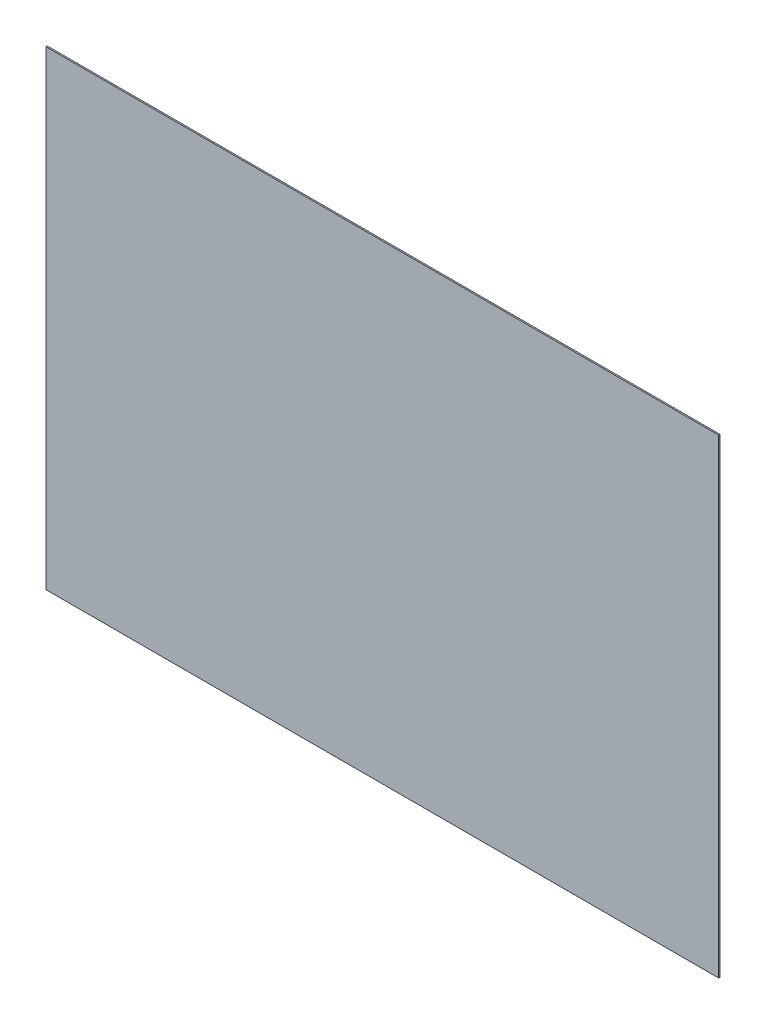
ISO-10303-21;
HEADER;
FILE_DESCRIPTION(('STEP AP214'),'2;1');
FILE_NAME('part.step','',(''),(''),'','','');
FILE_SCHEMA(('AUTOMOTIVE_DESIGN { 1 0 10303 214 1 1 1 1 }'));
ENDSEC;
DATA;
#1=APPLICATION_CONTEXT('core data for automotive mechanical design processes');
#2=APPLICATION_PROTOCOL_DEFINITION('international standard','automotive_design',2000,#1);
#3=PRODUCT_CONTEXT('',#1,'mechanical');
#4=PRODUCT('Part','Part','',(#3));
#5=PRODUCT_RELATED_PRODUCT_CATEGORY('part','',(#4));
#6=PRODUCT_DEFINITION_FORMATION('','',#4);
#7=PRODUCT_DEFINITION_CONTEXT('part definition',#1,'design');
#8=PRODUCT_DEFINITION('design','',#6,#7);
#9=PRODUCT_DEFINITION_SHAPE('','',#8);
#10=(LENGTH_UNIT() NAMED_UNIT(*) SI_UNIT(.MILLI.,.METRE.));
#11=(NAMED_UNIT(*) PLANE_ANGLE_UNIT() SI_UNIT($,.RADIAN.));
#12=(NAMED_UNIT(*) SI_UNIT($,.STERADIAN.) SOLID_ANGLE_UNIT());
#13=UNCERTAINTY_MEASURE_WITH_UNIT(LENGTH_MEASURE(1.E-05),#10,'distance_accuracy_value','');
#14=(GEOMETRIC_REPRESENTATION_CONTEXT(3) GLOBAL_UNCERTAINTY_ASSIGNED_CONTEXT((#13)) GLOBAL_UNIT_ASSIGNED_CONTEXT((#10,
#11,#12)) REPRESENTATION_CONTEXT('',''));
#15=CARTESIAN_POINT('',(0.,0.,0.));
#16=DIRECTION('',(0.,0.,1.));
#17=DIRECTION('',(1.,0.,0.));
#18=AXIS2_PLACEMENT_3D('',#15,#16,#17);
#19=CARTESIAN_POINT('',(0.,0.,2.));
#20=DIRECTION('',(1.,0.,0.));
#21=DIRECTION('',(0.,0.,-1.));
#22=AXIS2_PLACEMENT_3D('',#19,#20,#21);
#23=PLANE('',#22);
#24=DIRECTION('',(0.,-1.,0.));
#25=VECTOR('',#24,1.);
#26=CARTESIAN_POINT('',(0.,0.,0.));
#27=LINE('',#26,#25);
#28=CARTESIAN_POINT('',(0.,697.,0.));
#29=VERTEX_POINT('',#28);
#30=CARTESIAN_POINT('',(0.,0.,0.));
#31=VERTEX_POINT('',#30);
#32=EDGE_CURVE('E100',#29,#31,#27,.T.);
#33=ORIENTED_EDGE('',*,*,#32,.T.);
#34=DIRECTION('',(0.,0.,-1.));
#35=VECTOR('',#34,1.);
#36=CARTESIAN_POINT('',(0.,0.,2.));
#37=LINE('',#36,#35);
#38=CARTESIAN_POINT('',(0.,0.,2.));
#39=VERTEX_POINT('',#38);
#40=EDGE_CURVE('E11',#39,#31,#37,.T.);
#41=ORIENTED_EDGE('',*,*,#40,.F.);
#42=DIRECTION('',(0.,-1.,0.));
#43=VECTOR('',#42,1.);
#44=CARTESIAN_POINT('',(0.,0.,2.));
#45=LINE('',#44,#43);
#46=CARTESIAN_POINT('',(0.,697.,2.));
#47=VERTEX_POINT('',#46);
#48=EDGE_CURVE('E88',#47,#39,#45,.T.);
#49=ORIENTED_EDGE('',*,*,#48,.F.);
#50=DIRECTION('',(0.,0.,-1.));
#51=VECTOR('',#50,1.);
#52=CARTESIAN_POINT('',(0.,697.,2.));
#53=LINE('',#52,#51);
#54=EDGE_CURVE('E96',#47,#29,#53,.T.);
#55=ORIENTED_EDGE('',*,*,#54,.T.);
#56=EDGE_LOOP('',(#33,#41,#49,#55));
#57=FACE_BOUND('',#56,.T.);
#58=ADVANCED_FACE('F37',(#57),#23,.F.);
#59=CARTESIAN_POINT('',(0.,0.,2.));
#60=DIRECTION('',(0.,1.,0.));
#61=DIRECTION('',(0.,0.,1.));
#62=AXIS2_PLACEMENT_3D('',#59,#60,#61);
#63=PLANE('',#62);
#64=DIRECTION('',(1.,0.,0.));
#65=VECTOR('',#64,1.);
#66=CARTESIAN_POINT('',(0.,0.,0.));
#67=LINE('',#66,#65);
#68=CARTESIAN_POINT('',(997.,0.,0.));
#69=VERTEX_POINT('',#68);
#70=EDGE_CURVE('E92',#31,#69,#67,.T.);
#71=ORIENTED_EDGE('',*,*,#70,.T.);
#72=DIRECTION('',(0.,0.,-1.));
#73=VECTOR('',#72,1.);
#74=CARTESIAN_POINT('',(997.,0.,2.));
#75=LINE('',#74,#73);
#76=CARTESIAN_POINT('',(997.,0.,2.));
#77=VERTEX_POINT('',#76);
#78=EDGE_CURVE('E45',#77,#69,#75,.T.);
#79=ORIENTED_EDGE('',*,*,#78,.F.);
#80=DIRECTION('',(1.,0.,0.));
#81=VECTOR('',#80,1.);
#82=CARTESIAN_POINT('',(0.,0.,2.));
#83=LINE('',#82,#81);
#84=EDGE_CURVE('E83',#39,#77,#83,.T.);
#85=ORIENTED_EDGE('',*,*,#84,.F.);
#86=ORIENTED_EDGE('',*,*,#40,.T.);
#87=EDGE_LOOP('',(#71,#79,#85,#86));
#88=FACE_BOUND('',#87,.T.);
#89=ADVANCED_FACE('F91',(#88),#63,.F.);
#90=CARTESIAN_POINT('',(997.,0.,2.));
#91=DIRECTION('',(-1.,0.,0.));
#92=DIRECTION('',(0.,0.,1.));
#93=AXIS2_PLACEMENT_3D('',#90,#91,#92);
#94=PLANE('',#93);
#95=DIRECTION('',(0.,1.,0.));
#96=VECTOR('',#95,1.);
#97=CARTESIAN_POINT('',(997.,0.,0.));
#98=LINE('',#97,#96);
#99=CARTESIAN_POINT('',(997.,697.,0.));
#100=VERTEX_POINT('',#99);
#101=EDGE_CURVE('E70',#69,#100,#98,.T.);
#102=ORIENTED_EDGE('',*,*,#101,.T.);
#103=DIRECTION('',(0.,0.,-1.));
#104=VECTOR('',#103,1.);
#105=CARTESIAN_POINT('',(997.,697.,2.));
#106=LINE('',#105,#104);
#107=CARTESIAN_POINT('',(997.,697.,2.));
#108=VERTEX_POINT('',#107);
#109=EDGE_CURVE('E93',#108,#100,#106,.T.);
#110=ORIENTED_EDGE('',*,*,#109,.F.);
#111=DIRECTION('',(0.,1.,0.));
#112=VECTOR('',#111,1.);
#113=CARTESIAN_POINT('',(997.,0.,2.));
#114=LINE('',#113,#112);
#115=EDGE_CURVE('E86',#77,#108,#114,.T.);
#116=ORIENTED_EDGE('',*,*,#115,.F.);
#117=ORIENTED_EDGE('',*,*,#78,.T.);
#118=EDGE_LOOP('',(#102,#110,#116,#117));
#119=FACE_BOUND('',#118,.T.);
#120=ADVANCED_FACE('F94',(#119),#94,.F.);
#121=CARTESIAN_POINT('',(0.,697.,2.));
#122=DIRECTION('',(0.,-1.,0.));
#123=DIRECTION('',(0.,0.,-1.));
#124=AXIS2_PLACEMENT_3D('',#121,#122,#123);
#125=PLANE('',#124);
#126=DIRECTION('',(-1.,0.,0.));
#127=VECTOR('',#126,1.);
#128=CARTESIAN_POINT('',(0.,697.,0.));
#129=LINE('',#128,#127);
#130=EDGE_CURVE('E76',#100,#29,#129,.T.);
#131=ORIENTED_EDGE('',*,*,#130,.T.);
#132=ORIENTED_EDGE('',*,*,#54,.F.);
#133=DIRECTION('',(-1.,0.,0.));
#134=VECTOR('',#133,1.);
#135=CARTESIAN_POINT('',(0.,697.,2.));
#136=LINE('',#135,#134);
#137=EDGE_CURVE('E53',#108,#47,#136,.T.);
#138=ORIENTED_EDGE('',*,*,#137,.F.);
#139=ORIENTED_EDGE('',*,*,#109,.T.);
#140=EDGE_LOOP('',(#131,#132,#138,#139));
#141=FACE_BOUND('',#140,.T.);
#142=ADVANCED_FACE('F107',(#141),#125,.F.);
#143=CARTESIAN_POINT('',(0.,697.,2.));
#144=DIRECTION('',(0.,0.,-1.));
#145=DIRECTION('',(-1.,0.,0.));
#146=AXIS2_PLACEMENT_3D('',#143,#144,#145);
#147=PLANE('',#146);
#148=ORIENTED_EDGE('',*,*,#48,.T.);
#149=ORIENTED_EDGE('',*,*,#84,.T.);
#150=ORIENTED_EDGE('',*,*,#115,.T.);
#151=ORIENTED_EDGE('',*,*,#137,.T.);
#152=EDGE_LOOP('',(#148,#149,#150,#151));
#153=FACE_BOUND('',#152,.T.);
#154=ADVANCED_FACE('F84',(#153),#147,.F.);
#155=CARTESIAN_POINT('',(0.,697.,0.));
#156=DIRECTION('',(0.,0.,-1.));
#157=DIRECTION('',(-1.,0.,0.));
#158=AXIS2_PLACEMENT_3D('',#155,#156,#157);
#159=PLANE('',#158);
#160=ORIENTED_EDGE('',*,*,#32,.F.);
#161=ORIENTED_EDGE('',*,*,#130,.F.);
#162=ORIENTED_EDGE('',*,*,#101,.F.);
#163=ORIENTED_EDGE('',*,*,#70,.F.);
#164=EDGE_LOOP('',(#160,#161,#162,#163));
#165=FACE_BOUND('',#164,.T.);
#166=ADVANCED_FACE('F110',(#165),#159,.T.);
#167=CLOSED_SHELL('',(#58,#89,#120,#142,#154,#166));
#168=MANIFOLD_SOLID_BREP('B2',#167);
#169=ADVANCED_BREP_SHAPE_REPRESENTATION('',(#18,#168),#14);
#170=SHAPE_DEFINITION_REPRESENTATION(#9,#169);
ENDSEC;
END-ISO-10303-21;
